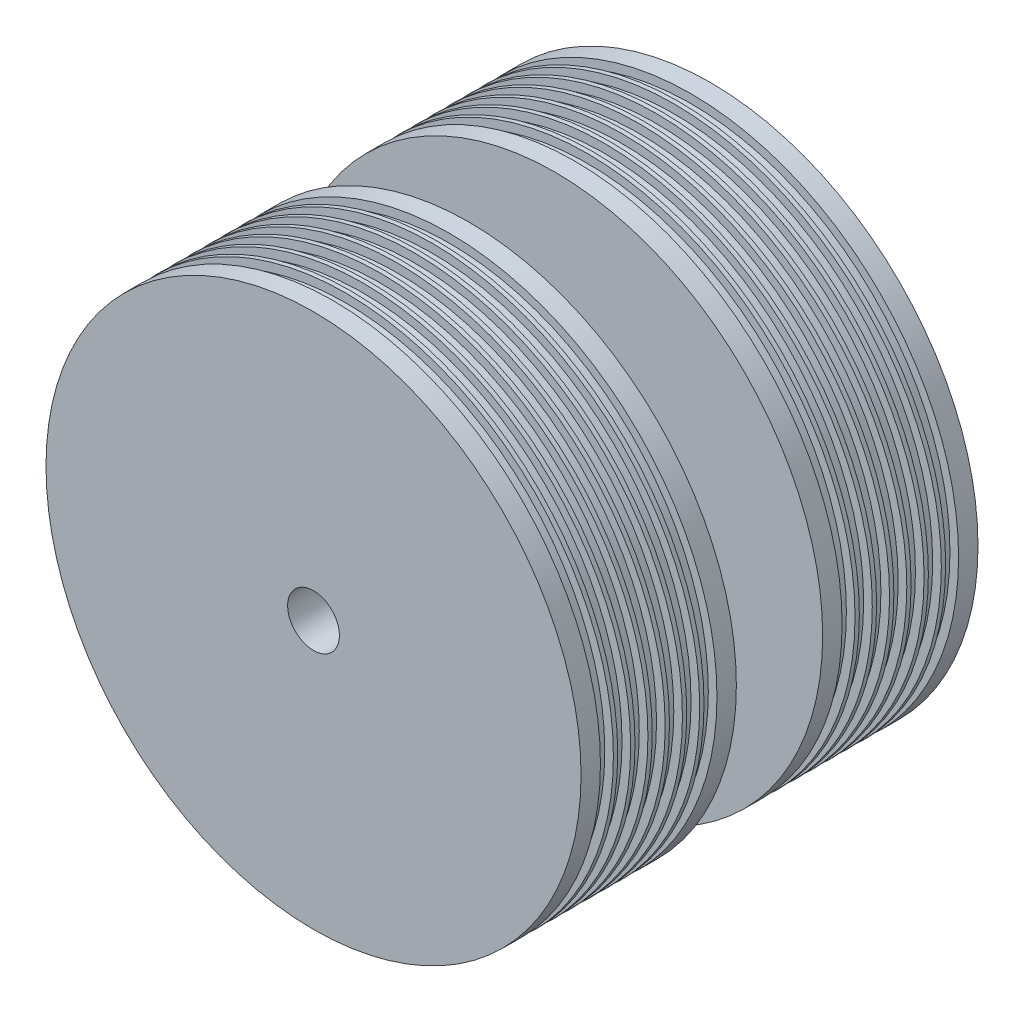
ISO-10303-21;
HEADER;
FILE_DESCRIPTION(('STEP AP214'),'2;1');
FILE_NAME('part.step','',(''),(''),'','','');
FILE_SCHEMA(('AUTOMOTIVE_DESIGN { 1 0 10303 214 1 1 1 1 }'));
ENDSEC;
DATA;
#1=APPLICATION_CONTEXT('core data for automotive mechanical design processes');
#2=APPLICATION_PROTOCOL_DEFINITION('international standard','automotive_design',2000,#1);
#3=PRODUCT_CONTEXT('',#1,'mechanical');
#4=PRODUCT('Part','Part','',(#3));
#5=PRODUCT_RELATED_PRODUCT_CATEGORY('part','',(#4));
#6=PRODUCT_DEFINITION_FORMATION('','',#4);
#7=PRODUCT_DEFINITION_CONTEXT('part definition',#1,'design');
#8=PRODUCT_DEFINITION('design','',#6,#7);
#9=PRODUCT_DEFINITION_SHAPE('','',#8);
#10=(LENGTH_UNIT() NAMED_UNIT(*) SI_UNIT(.MILLI.,.METRE.));
#11=(NAMED_UNIT(*) PLANE_ANGLE_UNIT() SI_UNIT($,.RADIAN.));
#12=(NAMED_UNIT(*) SI_UNIT($,.STERADIAN.) SOLID_ANGLE_UNIT());
#13=UNCERTAINTY_MEASURE_WITH_UNIT(LENGTH_MEASURE(1.E-05),#10,'distance_accuracy_value','');
#14=(GEOMETRIC_REPRESENTATION_CONTEXT(3) GLOBAL_UNCERTAINTY_ASSIGNED_CONTEXT((#13)) GLOBAL_UNIT_ASSIGNED_CONTEXT((#10,
#11,#12)) REPRESENTATION_CONTEXT('',''));
#15=CARTESIAN_POINT('',(0.,0.,0.));
#16=DIRECTION('',(0.,0.,1.));
#17=DIRECTION('',(1.,0.,0.));
#18=AXIS2_PLACEMENT_3D('',#15,#16,#17);
#19=CARTESIAN_POINT('',(0.,0.,0.));
#20=DIRECTION('',(0.,0.,1.));
#21=DIRECTION('',(1.,0.,0.));
#22=AXIS2_PLACEMENT_3D('',#19,#20,#21);
#23=CYLINDRICAL_SURFACE('',#22,15.5);
#24=CARTESIAN_POINT('',(0.,0.,-1.12500000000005));
#25=DIRECTION('',(0.,0.,1.));
#26=DIRECTION('',(1.,0.,0.));
#27=AXIS2_PLACEMENT_3D('',#24,#25,#26);
#28=CIRCLE('',#27,15.5);
#29=CARTESIAN_POINT('',(15.5,0.,-1.12500000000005));
#30=VERTEX_POINT('',#29);
#31=EDGE_CURVE('E11',#30,#30,#28,.T.);
#32=ORIENTED_EDGE('',*,*,#31,.T.);
#33=EDGE_LOOP('',(#32));
#34=FACE_BOUND('',#33,.T.);
#35=CARTESIAN_POINT('',(0.,0.,0.));
#36=DIRECTION('',(0.,0.,1.));
#37=DIRECTION('',(1.,0.,0.));
#38=AXIS2_PLACEMENT_3D('',#35,#36,#37);
#39=CIRCLE('',#38,15.5);
#40=CARTESIAN_POINT('',(15.5,0.,0.));
#41=VERTEX_POINT('',#40);
#42=EDGE_CURVE('E187',#41,#41,#39,.T.);
#43=ORIENTED_EDGE('',*,*,#42,.F.);
#44=EDGE_LOOP('',(#43));
#45=FACE_BOUND('',#44,.T.);
#46=ADVANCED_FACE('F55',(#34,#45),#23,.T.);
#47=CARTESIAN_POINT('',(0.,0.,-1.12500000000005));
#48=DIRECTION('',(0.,0.,-1.));
#49=DIRECTION('',(-1.,0.,0.));
#50=AXIS2_PLACEMENT_3D('',#47,#48,#49);
#51=PLANE('',#50);
#52=CARTESIAN_POINT('',(0.,0.,-1.12500000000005));
#53=DIRECTION('',(0.,0.,1.));
#54=DIRECTION('',(1.,0.,0.));
#55=AXIS2_PLACEMENT_3D('',#52,#53,#54);
#56=CIRCLE('',#55,15.0000000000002);
#57=CARTESIAN_POINT('',(15.0000000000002,0.,-1.12500000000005));
#58=VERTEX_POINT('',#57);
#59=EDGE_CURVE('E63',#58,#58,#56,.T.);
#60=ORIENTED_EDGE('',*,*,#59,.T.);
#61=EDGE_LOOP('',(#60));
#62=FACE_BOUND('',#61,.T.);
#63=ORIENTED_EDGE('',*,*,#31,.F.);
#64=EDGE_LOOP('',(#63));
#65=FACE_BOUND('',#64,.T.);
#66=ADVANCED_FACE('F57',(#62,#65),#51,.T.);
#67=CARTESIAN_POINT('',(0.,0.,0.));
#68=DIRECTION('',(0.,0.,1.));
#69=DIRECTION('',(1.,0.,0.));
#70=AXIS2_PLACEMENT_3D('',#67,#68,#69);
#71=CYLINDRICAL_SURFACE('',#70,15.0000000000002);
#72=ORIENTED_EDGE('',*,*,#59,.F.);
#73=EDGE_LOOP('',(#72));
#74=FACE_BOUND('',#73,.T.);
#75=CARTESIAN_POINT('',(0.,0.,-1.87500000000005));
#76=DIRECTION('',(0.,0.,1.));
#77=DIRECTION('',(1.,0.,0.));
#78=AXIS2_PLACEMENT_3D('',#75,#76,#77);
#79=CIRCLE('',#78,15.0000000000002);
#80=CARTESIAN_POINT('',(15.0000000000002,0.,-1.87500000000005));
#81=VERTEX_POINT('',#80);
#82=EDGE_CURVE('E68',#81,#81,#79,.T.);
#83=ORIENTED_EDGE('',*,*,#82,.T.);
#84=EDGE_LOOP('',(#83));
#85=FACE_BOUND('',#84,.T.);
#86=ADVANCED_FACE('F202',(#74,#85),#71,.T.);
#87=CARTESIAN_POINT('',(0.,0.,-1.87500000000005));
#88=DIRECTION('',(0.,0.,-1.));
#89=DIRECTION('',(-1.,0.,0.));
#90=AXIS2_PLACEMENT_3D('',#87,#88,#89);
#91=PLANE('',#90);
#92=ORIENTED_EDGE('',*,*,#82,.F.);
#93=EDGE_LOOP('',(#92));
#94=FACE_BOUND('',#93,.T.);
#95=CARTESIAN_POINT('',(0.,0.,-1.87500000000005));
#96=DIRECTION('',(0.,0.,1.));
#97=DIRECTION('',(1.,0.,0.));
#98=AXIS2_PLACEMENT_3D('',#95,#96,#97);
#99=CIRCLE('',#98,15.5);
#100=CARTESIAN_POINT('',(15.5,0.,-1.87500000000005));
#101=VERTEX_POINT('',#100);
#102=EDGE_CURVE('E73',#101,#101,#99,.T.);
#103=ORIENTED_EDGE('',*,*,#102,.T.);
#104=EDGE_LOOP('',(#103));
#105=FACE_BOUND('',#104,.T.);
#106=ADVANCED_FACE('F207',(#94,#105),#91,.F.);
#107=CARTESIAN_POINT('',(0.,0.,-2.12500000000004));
#108=DIRECTION('',(0.,0.,1.));
#109=DIRECTION('',(1.,0.,0.));
#110=AXIS2_PLACEMENT_3D('',#107,#108,#109);
#111=CIRCLE('',#110,15.5);
#112=CARTESIAN_POINT('',(15.5,0.,-2.12500000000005));
#113=VERTEX_POINT('',#112);
#114=EDGE_CURVE('E79',#113,#113,#111,.T.);
#115=ORIENTED_EDGE('',*,*,#114,.T.);
#116=EDGE_LOOP('',(#115));
#117=FACE_BOUND('',#116,.T.);
#118=ORIENTED_EDGE('',*,*,#102,.F.);
#119=EDGE_LOOP('',(#118));
#120=FACE_BOUND('',#119,.T.);
#121=ADVANCED_FACE('F197',(#117,#120),#23,.T.);
#122=CARTESIAN_POINT('',(0.,0.,-2.12500000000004));
#123=DIRECTION('',(0.,0.,-1.));
#124=DIRECTION('',(-1.,0.,0.));
#125=AXIS2_PLACEMENT_3D('',#122,#123,#124);
#126=PLANE('',#125);
#127=CARTESIAN_POINT('',(0.,0.,-2.12500000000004));
#128=DIRECTION('',(0.,0.,1.));
#129=DIRECTION('',(1.,0.,0.));
#130=AXIS2_PLACEMENT_3D('',#127,#128,#129);
#131=CIRCLE('',#130,15.0000000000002);
#132=CARTESIAN_POINT('',(15.0000000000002,0.,-2.12500000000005));
#133=VERTEX_POINT('',#132);
#134=EDGE_CURVE('E83',#133,#133,#131,.T.);
#135=ORIENTED_EDGE('',*,*,#134,.T.);
#136=EDGE_LOOP('',(#135));
#137=FACE_BOUND('',#136,.T.);
#138=ORIENTED_EDGE('',*,*,#114,.F.);
#139=EDGE_LOOP('',(#138));
#140=FACE_BOUND('',#139,.T.);
#141=ADVANCED_FACE('F206',(#137,#140),#126,.T.);
#142=CARTESIAN_POINT('',(0.,0.,0.));
#143=DIRECTION('',(0.,0.,1.));
#144=DIRECTION('',(1.,0.,0.));
#145=AXIS2_PLACEMENT_3D('',#142,#143,#144);
#146=CYLINDRICAL_SURFACE('',#145,15.0000000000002);
#147=ORIENTED_EDGE('',*,*,#134,.F.);
#148=EDGE_LOOP('',(#147));
#149=FACE_BOUND('',#148,.T.);
#150=CARTESIAN_POINT('',(0.,0.,-2.87500000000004));
#151=DIRECTION('',(0.,0.,1.));
#152=DIRECTION('',(1.,0.,0.));
#153=AXIS2_PLACEMENT_3D('',#150,#151,#152);
#154=CIRCLE('',#153,15.0000000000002);
#155=CARTESIAN_POINT('',(15.0000000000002,0.,-2.87500000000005));
#156=VERTEX_POINT('',#155);
#157=EDGE_CURVE('E87',#156,#156,#154,.T.);
#158=ORIENTED_EDGE('',*,*,#157,.T.);
#159=EDGE_LOOP('',(#158));
#160=FACE_BOUND('',#159,.T.);
#161=ADVANCED_FACE('F293',(#149,#160),#146,.T.);
#162=CARTESIAN_POINT('',(0.,0.,-2.87500000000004));
#163=DIRECTION('',(0.,0.,-1.));
#164=DIRECTION('',(-1.,0.,0.));
#165=AXIS2_PLACEMENT_3D('',#162,#163,#164);
#166=PLANE('',#165);
#167=ORIENTED_EDGE('',*,*,#157,.F.);
#168=EDGE_LOOP('',(#167));
#169=FACE_BOUND('',#168,.T.);
#170=CARTESIAN_POINT('',(0.,0.,-2.87500000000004));
#171=DIRECTION('',(0.,0.,1.));
#172=DIRECTION('',(1.,0.,0.));
#173=AXIS2_PLACEMENT_3D('',#170,#171,#172);
#174=CIRCLE('',#173,15.5);
#175=CARTESIAN_POINT('',(15.5,0.,-2.87500000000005));
#176=VERTEX_POINT('',#175);
#177=EDGE_CURVE('E91',#176,#176,#174,.T.);
#178=ORIENTED_EDGE('',*,*,#177,.T.);
#179=EDGE_LOOP('',(#178));
#180=FACE_BOUND('',#179,.T.);
#181=ADVANCED_FACE('F285',(#169,#180),#166,.F.);
#182=CARTESIAN_POINT('',(0.,0.,-3.12500000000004));
#183=DIRECTION('',(0.,0.,1.));
#184=DIRECTION('',(1.,0.,0.));
#185=AXIS2_PLACEMENT_3D('',#182,#183,#184);
#186=CIRCLE('',#185,15.5);
#187=CARTESIAN_POINT('',(15.5,0.,-3.12500000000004));
#188=VERTEX_POINT('',#187);
#189=EDGE_CURVE('E95',#188,#188,#186,.T.);
#190=ORIENTED_EDGE('',*,*,#189,.T.);
#191=EDGE_LOOP('',(#190));
#192=FACE_BOUND('',#191,.T.);
#193=ORIENTED_EDGE('',*,*,#177,.F.);
#194=EDGE_LOOP('',(#193));
#195=FACE_BOUND('',#194,.T.);
#196=ADVANCED_FACE('F209',(#192,#195),#23,.T.);
#197=CARTESIAN_POINT('',(0.,0.,-3.12500000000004));
#198=DIRECTION('',(0.,0.,-1.));
#199=DIRECTION('',(-1.,0.,0.));
#200=AXIS2_PLACEMENT_3D('',#197,#198,#199);
#201=PLANE('',#200);
#202=CARTESIAN_POINT('',(0.,0.,-3.12500000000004));
#203=DIRECTION('',(0.,0.,1.));
#204=DIRECTION('',(1.,0.,0.));
#205=AXIS2_PLACEMENT_3D('',#202,#203,#204);
#206=CIRCLE('',#205,15.0000000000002);
#207=CARTESIAN_POINT('',(15.0000000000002,0.,-3.12500000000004));
#208=VERTEX_POINT('',#207);
#209=EDGE_CURVE('E99',#208,#208,#206,.T.);
#210=ORIENTED_EDGE('',*,*,#209,.T.);
#211=EDGE_LOOP('',(#210));
#212=FACE_BOUND('',#211,.T.);
#213=ORIENTED_EDGE('',*,*,#189,.F.);
#214=EDGE_LOOP('',(#213));
#215=FACE_BOUND('',#214,.T.);
#216=ADVANCED_FACE('F284',(#212,#215),#201,.T.);
#217=CARTESIAN_POINT('',(0.,0.,0.));
#218=DIRECTION('',(0.,0.,1.));
#219=DIRECTION('',(1.,0.,0.));
#220=AXIS2_PLACEMENT_3D('',#217,#218,#219);
#221=CYLINDRICAL_SURFACE('',#220,15.0000000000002);
#222=ORIENTED_EDGE('',*,*,#209,.F.);
#223=EDGE_LOOP('',(#222));
#224=FACE_BOUND('',#223,.T.);
#225=CARTESIAN_POINT('',(0.,0.,-3.87500000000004));
#226=DIRECTION('',(0.,0.,1.));
#227=DIRECTION('',(1.,0.,0.));
#228=AXIS2_PLACEMENT_3D('',#225,#226,#227);
#229=CIRCLE('',#228,15.0000000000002);
#230=CARTESIAN_POINT('',(15.0000000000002,0.,-3.87500000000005));
#231=VERTEX_POINT('',#230);
#232=EDGE_CURVE('E103',#231,#231,#229,.T.);
#233=ORIENTED_EDGE('',*,*,#232,.T.);
#234=EDGE_LOOP('',(#233));
#235=FACE_BOUND('',#234,.T.);
#236=ADVANCED_FACE('F279',(#224,#235),#221,.T.);
#237=CARTESIAN_POINT('',(0.,0.,-3.87500000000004));
#238=DIRECTION('',(0.,0.,-1.));
#239=DIRECTION('',(-1.,0.,0.));
#240=AXIS2_PLACEMENT_3D('',#237,#238,#239);
#241=PLANE('',#240);
#242=ORIENTED_EDGE('',*,*,#232,.F.);
#243=EDGE_LOOP('',(#242));
#244=FACE_BOUND('',#243,.T.);
#245=CARTESIAN_POINT('',(0.,0.,-3.87500000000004));
#246=DIRECTION('',(0.,0.,1.));
#247=DIRECTION('',(1.,0.,0.));
#248=AXIS2_PLACEMENT_3D('',#245,#246,#247);
#249=CIRCLE('',#248,15.5);
#250=CARTESIAN_POINT('',(15.5,0.,-3.87500000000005));
#251=VERTEX_POINT('',#250);
#252=EDGE_CURVE('E107',#251,#251,#249,.T.);
#253=ORIENTED_EDGE('',*,*,#252,.T.);
#254=EDGE_LOOP('',(#253));
#255=FACE_BOUND('',#254,.T.);
#256=ADVANCED_FACE('F271',(#244,#255),#241,.F.);
#257=CARTESIAN_POINT('',(0.,0.,-4.12500000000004));
#258=DIRECTION('',(0.,0.,1.));
#259=DIRECTION('',(1.,0.,0.));
#260=AXIS2_PLACEMENT_3D('',#257,#258,#259);
#261=CIRCLE('',#260,15.5);
#262=CARTESIAN_POINT('',(15.5,0.,-4.12500000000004));
#263=VERTEX_POINT('',#262);
#264=EDGE_CURVE('E111',#263,#263,#261,.T.);
#265=ORIENTED_EDGE('',*,*,#264,.T.);
#266=EDGE_LOOP('',(#265));
#267=FACE_BOUND('',#266,.T.);
#268=ORIENTED_EDGE('',*,*,#252,.F.);
#269=EDGE_LOOP('',(#268));
#270=FACE_BOUND('',#269,.T.);
#271=ADVANCED_FACE('F258',(#267,#270),#23,.T.);
#272=CARTESIAN_POINT('',(0.,0.,-4.12500000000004));
#273=DIRECTION('',(0.,0.,-1.));
#274=DIRECTION('',(-1.,0.,0.));
#275=AXIS2_PLACEMENT_3D('',#272,#273,#274);
#276=PLANE('',#275);
#277=CARTESIAN_POINT('',(0.,0.,-4.12500000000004));
#278=DIRECTION('',(0.,0.,1.));
#279=DIRECTION('',(1.,0.,0.));
#280=AXIS2_PLACEMENT_3D('',#277,#278,#279);
#281=CIRCLE('',#280,15.0000000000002);
#282=CARTESIAN_POINT('',(15.0000000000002,0.,-4.12500000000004));
#283=VERTEX_POINT('',#282);
#284=EDGE_CURVE('E115',#283,#283,#281,.T.);
#285=ORIENTED_EDGE('',*,*,#284,.T.);
#286=EDGE_LOOP('',(#285));
#287=FACE_BOUND('',#286,.T.);
#288=ORIENTED_EDGE('',*,*,#264,.F.);
#289=EDGE_LOOP('',(#288));
#290=FACE_BOUND('',#289,.T.);
#291=ADVANCED_FACE('F270',(#287,#290),#276,.T.);
#292=CARTESIAN_POINT('',(0.,0.,0.));
#293=DIRECTION('',(0.,0.,1.));
#294=DIRECTION('',(1.,0.,0.));
#295=AXIS2_PLACEMENT_3D('',#292,#293,#294);
#296=CYLINDRICAL_SURFACE('',#295,15.0000000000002);
#297=ORIENTED_EDGE('',*,*,#284,.F.);
#298=EDGE_LOOP('',(#297));
#299=FACE_BOUND('',#298,.T.);
#300=CARTESIAN_POINT('',(0.,0.,-4.87500000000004));
#301=DIRECTION('',(0.,0.,1.));
#302=DIRECTION('',(1.,0.,0.));
#303=AXIS2_PLACEMENT_3D('',#300,#301,#302);
#304=CIRCLE('',#303,15.0000000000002);
#305=CARTESIAN_POINT('',(15.0000000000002,0.,-4.87500000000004));
#306=VERTEX_POINT('',#305);
#307=EDGE_CURVE('E119',#306,#306,#304,.T.);
#308=ORIENTED_EDGE('',*,*,#307,.T.);
#309=EDGE_LOOP('',(#308));
#310=FACE_BOUND('',#309,.T.);
#311=ADVANCED_FACE('F265',(#299,#310),#296,.T.);
#312=CARTESIAN_POINT('',(0.,0.,-4.87500000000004));
#313=DIRECTION('',(0.,0.,-1.));
#314=DIRECTION('',(-1.,0.,0.));
#315=AXIS2_PLACEMENT_3D('',#312,#313,#314);
#316=PLANE('',#315);
#317=ORIENTED_EDGE('',*,*,#307,.F.);
#318=EDGE_LOOP('',(#317));
#319=FACE_BOUND('',#318,.T.);
#320=CARTESIAN_POINT('',(0.,0.,-4.87500000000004));
#321=DIRECTION('',(0.,0.,1.));
#322=DIRECTION('',(1.,0.,0.));
#323=AXIS2_PLACEMENT_3D('',#320,#321,#322);
#324=CIRCLE('',#323,15.5);
#325=CARTESIAN_POINT('',(15.5,0.,-4.87500000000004));
#326=VERTEX_POINT('',#325);
#327=EDGE_CURVE('E123',#326,#326,#324,.T.);
#328=ORIENTED_EDGE('',*,*,#327,.T.);
#329=EDGE_LOOP('',(#328));
#330=FACE_BOUND('',#329,.T.);
#331=ADVANCED_FACE('F256',(#319,#330),#316,.F.);
#332=CARTESIAN_POINT('',(0.,0.,-5.12500000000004));
#333=DIRECTION('',(0.,0.,1.));
#334=DIRECTION('',(1.,0.,0.));
#335=AXIS2_PLACEMENT_3D('',#332,#333,#334);
#336=CIRCLE('',#335,15.5);
#337=CARTESIAN_POINT('',(15.5,0.,-5.12500000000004));
#338=VERTEX_POINT('',#337);
#339=EDGE_CURVE('E127',#338,#338,#336,.T.);
#340=ORIENTED_EDGE('',*,*,#339,.T.);
#341=EDGE_LOOP('',(#340));
#342=FACE_BOUND('',#341,.T.);
#343=ORIENTED_EDGE('',*,*,#327,.F.);
#344=EDGE_LOOP('',(#343));
#345=FACE_BOUND('',#344,.T.);
#346=ADVANCED_FACE('F243',(#342,#345),#23,.T.);
#347=CARTESIAN_POINT('',(0.,0.,-5.12500000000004));
#348=DIRECTION('',(0.,0.,-1.));
#349=DIRECTION('',(-1.,0.,0.));
#350=AXIS2_PLACEMENT_3D('',#347,#348,#349);
#351=PLANE('',#350);
#352=CARTESIAN_POINT('',(0.,0.,-5.12500000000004));
#353=DIRECTION('',(0.,0.,1.));
#354=DIRECTION('',(1.,0.,0.));
#355=AXIS2_PLACEMENT_3D('',#352,#353,#354);
#356=CIRCLE('',#355,15.0000000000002);
#357=CARTESIAN_POINT('',(15.0000000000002,0.,-5.12500000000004));
#358=VERTEX_POINT('',#357);
#359=EDGE_CURVE('E131',#358,#358,#356,.T.);
#360=ORIENTED_EDGE('',*,*,#359,.T.);
#361=EDGE_LOOP('',(#360));
#362=FACE_BOUND('',#361,.T.);
#363=ORIENTED_EDGE('',*,*,#339,.F.);
#364=EDGE_LOOP('',(#363));
#365=FACE_BOUND('',#364,.T.);
#366=ADVANCED_FACE('F255',(#362,#365),#351,.T.);
#367=CARTESIAN_POINT('',(0.,0.,0.));
#368=DIRECTION('',(0.,0.,1.));
#369=DIRECTION('',(1.,0.,0.));
#370=AXIS2_PLACEMENT_3D('',#367,#368,#369);
#371=CYLINDRICAL_SURFACE('',#370,15.0000000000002);
#372=ORIENTED_EDGE('',*,*,#359,.F.);
#373=EDGE_LOOP('',(#372));
#374=FACE_BOUND('',#373,.T.);
#375=CARTESIAN_POINT('',(0.,0.,-5.87500000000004));
#376=DIRECTION('',(0.,0.,1.));
#377=DIRECTION('',(1.,0.,0.));
#378=AXIS2_PLACEMENT_3D('',#375,#376,#377);
#379=CIRCLE('',#378,15.0000000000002);
#380=CARTESIAN_POINT('',(15.0000000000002,0.,-5.87500000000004));
#381=VERTEX_POINT('',#380);
#382=EDGE_CURVE('E135',#381,#381,#379,.T.);
#383=ORIENTED_EDGE('',*,*,#382,.T.);
#384=EDGE_LOOP('',(#383));
#385=FACE_BOUND('',#384,.T.);
#386=ADVANCED_FACE('F250',(#374,#385),#371,.T.);
#387=CARTESIAN_POINT('',(0.,0.,-5.87500000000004));
#388=DIRECTION('',(0.,0.,-1.));
#389=DIRECTION('',(-1.,0.,0.));
#390=AXIS2_PLACEMENT_3D('',#387,#388,#389);
#391=PLANE('',#390);
#392=ORIENTED_EDGE('',*,*,#382,.F.);
#393=EDGE_LOOP('',(#392));
#394=FACE_BOUND('',#393,.T.);
#395=CARTESIAN_POINT('',(0.,0.,-5.87500000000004));
#396=DIRECTION('',(0.,0.,1.));
#397=DIRECTION('',(1.,0.,0.));
#398=AXIS2_PLACEMENT_3D('',#395,#396,#397);
#399=CIRCLE('',#398,15.5);
#400=CARTESIAN_POINT('',(15.5,0.,-5.87500000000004));
#401=VERTEX_POINT('',#400);
#402=EDGE_CURVE('E139',#401,#401,#399,.T.);
#403=ORIENTED_EDGE('',*,*,#402,.T.);
#404=EDGE_LOOP('',(#403));
#405=FACE_BOUND('',#404,.T.);
#406=ADVANCED_FACE('F241',(#394,#405),#391,.F.);
#407=CARTESIAN_POINT('',(0.,0.,-6.12500000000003));
#408=DIRECTION('',(0.,0.,1.));
#409=DIRECTION('',(1.,0.,0.));
#410=AXIS2_PLACEMENT_3D('',#407,#408,#409);
#411=CIRCLE('',#410,15.5);
#412=CARTESIAN_POINT('',(15.5,0.,-6.12500000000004));
#413=VERTEX_POINT('',#412);
#414=EDGE_CURVE('E143',#413,#413,#411,.T.);
#415=ORIENTED_EDGE('',*,*,#414,.T.);
#416=EDGE_LOOP('',(#415));
#417=FACE_BOUND('',#416,.T.);
#418=ORIENTED_EDGE('',*,*,#402,.F.);
#419=EDGE_LOOP('',(#418));
#420=FACE_BOUND('',#419,.T.);
#421=ADVANCED_FACE('F228',(#417,#420),#23,.T.);
#422=CARTESIAN_POINT('',(0.,0.,-6.12500000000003));
#423=DIRECTION('',(0.,0.,-1.));
#424=DIRECTION('',(-1.,0.,0.));
#425=AXIS2_PLACEMENT_3D('',#422,#423,#424);
#426=PLANE('',#425);
#427=CARTESIAN_POINT('',(0.,0.,-6.12500000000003));
#428=DIRECTION('',(0.,0.,1.));
#429=DIRECTION('',(1.,0.,0.));
#430=AXIS2_PLACEMENT_3D('',#427,#428,#429);
#431=CIRCLE('',#430,15.0000000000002);
#432=CARTESIAN_POINT('',(15.0000000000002,0.,-6.12500000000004));
#433=VERTEX_POINT('',#432);
#434=EDGE_CURVE('E147',#433,#433,#431,.T.);
#435=ORIENTED_EDGE('',*,*,#434,.T.);
#436=EDGE_LOOP('',(#435));
#437=FACE_BOUND('',#436,.T.);
#438=ORIENTED_EDGE('',*,*,#414,.F.);
#439=EDGE_LOOP('',(#438));
#440=FACE_BOUND('',#439,.T.);
#441=ADVANCED_FACE('F240',(#437,#440),#426,.T.);
#442=CARTESIAN_POINT('',(0.,0.,0.));
#443=DIRECTION('',(0.,0.,1.));
#444=DIRECTION('',(1.,0.,0.));
#445=AXIS2_PLACEMENT_3D('',#442,#443,#444);
#446=CYLINDRICAL_SURFACE('',#445,15.0000000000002);
#447=ORIENTED_EDGE('',*,*,#434,.F.);
#448=EDGE_LOOP('',(#447));
#449=FACE_BOUND('',#448,.T.);
#450=CARTESIAN_POINT('',(0.,0.,-6.87500000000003));
#451=DIRECTION('',(0.,0.,1.));
#452=DIRECTION('',(1.,0.,0.));
#453=AXIS2_PLACEMENT_3D('',#450,#451,#452);
#454=CIRCLE('',#453,15.0000000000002);
#455=CARTESIAN_POINT('',(15.0000000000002,0.,-6.87500000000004));
#456=VERTEX_POINT('',#455);
#457=EDGE_CURVE('E151',#456,#456,#454,.T.);
#458=ORIENTED_EDGE('',*,*,#457,.T.);
#459=EDGE_LOOP('',(#458));
#460=FACE_BOUND('',#459,.T.);
#461=ADVANCED_FACE('F235',(#449,#460),#446,.T.);
#462=CARTESIAN_POINT('',(0.,0.,-6.87500000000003));
#463=DIRECTION('',(0.,0.,-1.));
#464=DIRECTION('',(-1.,0.,0.));
#465=AXIS2_PLACEMENT_3D('',#462,#463,#464);
#466=PLANE('',#465);
#467=ORIENTED_EDGE('',*,*,#457,.F.);
#468=EDGE_LOOP('',(#467));
#469=FACE_BOUND('',#468,.T.);
#470=CARTESIAN_POINT('',(0.,0.,-6.87500000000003));
#471=DIRECTION('',(0.,0.,1.));
#472=DIRECTION('',(1.,0.,0.));
#473=AXIS2_PLACEMENT_3D('',#470,#471,#472);
#474=CIRCLE('',#473,15.5);
#475=CARTESIAN_POINT('',(15.5,0.,-6.87500000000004));
#476=VERTEX_POINT('',#475);
#477=EDGE_CURVE('E155',#476,#476,#474,.T.);
#478=ORIENTED_EDGE('',*,*,#477,.T.);
#479=EDGE_LOOP('',(#478));
#480=FACE_BOUND('',#479,.T.);
#481=ADVANCED_FACE('F226',(#469,#480),#466,.F.);
#482=CARTESIAN_POINT('',(0.,0.,-7.12500000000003));
#483=DIRECTION('',(0.,0.,1.));
#484=DIRECTION('',(1.,0.,0.));
#485=AXIS2_PLACEMENT_3D('',#482,#483,#484);
#486=CIRCLE('',#485,15.5);
#487=CARTESIAN_POINT('',(15.5,0.,-7.12500000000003));
#488=VERTEX_POINT('',#487);
#489=EDGE_CURVE('E159',#488,#488,#486,.T.);
#490=ORIENTED_EDGE('',*,*,#489,.T.);
#491=EDGE_LOOP('',(#490));
#492=FACE_BOUND('',#491,.T.);
#493=ORIENTED_EDGE('',*,*,#477,.F.);
#494=EDGE_LOOP('',(#493));
#495=FACE_BOUND('',#494,.T.);
#496=ADVANCED_FACE('F214',(#492,#495),#23,.T.);
#497=CARTESIAN_POINT('',(0.,0.,-7.12500000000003));
#498=DIRECTION('',(0.,0.,-1.));
#499=DIRECTION('',(-1.,0.,0.));
#500=AXIS2_PLACEMENT_3D('',#497,#498,#499);
#501=PLANE('',#500);
#502=CARTESIAN_POINT('',(0.,0.,-7.12500000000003));
#503=DIRECTION('',(0.,0.,1.));
#504=DIRECTION('',(1.,0.,0.));
#505=AXIS2_PLACEMENT_3D('',#502,#503,#504);
#506=CIRCLE('',#505,15.0000000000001);
#507=CARTESIAN_POINT('',(15.0000000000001,0.,-7.12500000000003));
#508=VERTEX_POINT('',#507);
#509=EDGE_CURVE('E163',#508,#508,#506,.T.);
#510=ORIENTED_EDGE('',*,*,#509,.T.);
#511=EDGE_LOOP('',(#510));
#512=FACE_BOUND('',#511,.T.);
#513=ORIENTED_EDGE('',*,*,#489,.F.);
#514=EDGE_LOOP('',(#513));
#515=FACE_BOUND('',#514,.T.);
#516=ADVANCED_FACE('F225',(#512,#515),#501,.T.);
#517=CARTESIAN_POINT('',(0.,0.,0.));
#518=DIRECTION('',(0.,0.,1.));
#519=DIRECTION('',(1.,0.,0.));
#520=AXIS2_PLACEMENT_3D('',#517,#518,#519);
#521=CYLINDRICAL_SURFACE('',#520,15.0000000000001);
#522=ORIENTED_EDGE('',*,*,#509,.F.);
#523=EDGE_LOOP('',(#522));
#524=FACE_BOUND('',#523,.T.);
#525=CARTESIAN_POINT('',(0.,0.,-7.87500000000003));
#526=DIRECTION('',(0.,0.,1.));
#527=DIRECTION('',(1.,0.,0.));
#528=AXIS2_PLACEMENT_3D('',#525,#526,#527);
#529=CIRCLE('',#528,15.0000000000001);
#530=CARTESIAN_POINT('',(15.0000000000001,0.,-7.87500000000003));
#531=VERTEX_POINT('',#530);
#532=EDGE_CURVE('E167',#531,#531,#529,.T.);
#533=ORIENTED_EDGE('',*,*,#532,.T.);
#534=EDGE_LOOP('',(#533));
#535=FACE_BOUND('',#534,.T.);
#536=ADVANCED_FACE('F221',(#524,#535),#521,.T.);
#537=CARTESIAN_POINT('',(0.,0.,-7.87500000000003));
#538=DIRECTION('',(0.,0.,-1.));
#539=DIRECTION('',(-1.,0.,0.));
#540=AXIS2_PLACEMENT_3D('',#537,#538,#539);
#541=PLANE('',#540);
#542=ORIENTED_EDGE('',*,*,#532,.F.);
#543=EDGE_LOOP('',(#542));
#544=FACE_BOUND('',#543,.T.);
#545=CARTESIAN_POINT('',(0.,0.,-7.87500000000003));
#546=DIRECTION('',(0.,0.,1.));
#547=DIRECTION('',(1.,0.,0.));
#548=AXIS2_PLACEMENT_3D('',#545,#546,#547);
#549=CIRCLE('',#548,15.5);
#550=CARTESIAN_POINT('',(15.5,0.,-7.87500000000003));
#551=VERTEX_POINT('',#550);
#552=EDGE_CURVE('E171',#551,#551,#549,.T.);
#553=ORIENTED_EDGE('',*,*,#552,.T.);
#554=EDGE_LOOP('',(#553));
#555=FACE_BOUND('',#554,.T.);
#556=ADVANCED_FACE('F212',(#544,#555),#541,.F.);
#557=CARTESIAN_POINT('',(0.,0.,-9.));
#558=DIRECTION('',(0.,0.,1.));
#559=DIRECTION('',(1.,0.,0.));
#560=AXIS2_PLACEMENT_3D('',#557,#558,#559);
#561=CIRCLE('',#560,15.5);
#562=CARTESIAN_POINT('',(15.5,0.,-9.));
#563=VERTEX_POINT('',#562);
#564=EDGE_CURVE('E175',#563,#563,#561,.T.);
#565=ORIENTED_EDGE('',*,*,#564,.T.);
#566=EDGE_LOOP('',(#565));
#567=FACE_BOUND('',#566,.T.);
#568=ORIENTED_EDGE('',*,*,#552,.F.);
#569=EDGE_LOOP('',(#568));
#570=FACE_BOUND('',#569,.T.);
#571=ADVANCED_FACE('F198',(#567,#570),#23,.T.);
#572=CARTESIAN_POINT('',(0.,0.,-9.));
#573=DIRECTION('',(0.,0.,1.));
#574=DIRECTION('',(1.,0.,0.));
#575=AXIS2_PLACEMENT_3D('',#572,#573,#574);
#576=PLANE('',#575);
#577=ORIENTED_EDGE('',*,*,#564,.F.);
#578=EDGE_LOOP('',(#577));
#579=FACE_BOUND('',#578,.T.);
#580=CARTESIAN_POINT('',(0.,0.,-9.));
#581=DIRECTION('',(0.,0.,1.));
#582=DIRECTION('',(1.,0.,0.));
#583=AXIS2_PLACEMENT_3D('',#580,#581,#582);
#584=CIRCLE('',#583,1.5);
#585=CARTESIAN_POINT('',(1.5,0.,-9.));
#586=VERTEX_POINT('',#585);
#587=EDGE_CURVE('E179',#586,#586,#584,.T.);
#588=ORIENTED_EDGE('',*,*,#587,.T.);
#589=EDGE_LOOP('',(#588));
#590=FACE_BOUND('',#589,.T.);
#591=ADVANCED_FACE('F211',(#579,#590),#576,.F.);
#592=CARTESIAN_POINT('',(0.,0.,0.));
#593=DIRECTION('',(0.,0.,1.));
#594=DIRECTION('',(1.,0.,0.));
#595=AXIS2_PLACEMENT_3D('',#592,#593,#594);
#596=CYLINDRICAL_SURFACE('',#595,1.5);
#597=CARTESIAN_POINT('',(0.,0.,0.));
#598=DIRECTION('',(0.,0.,1.));
#599=DIRECTION('',(1.,0.,0.));
#600=AXIS2_PLACEMENT_3D('',#597,#598,#599);
#601=CIRCLE('',#600,1.5);
#602=CARTESIAN_POINT('',(1.5,0.,0.));
#603=VERTEX_POINT('',#602);
#604=EDGE_CURVE('E183',#603,#603,#601,.T.);
#605=ORIENTED_EDGE('',*,*,#604,.T.);
#606=EDGE_LOOP('',(#605));
#607=FACE_BOUND('',#606,.T.);
#608=ORIENTED_EDGE('',*,*,#587,.F.);
#609=EDGE_LOOP('',(#608));
#610=FACE_BOUND('',#609,.T.);
#611=ADVANCED_FACE('F219',(#607,#610),#596,.F.);
#612=CARTESIAN_POINT('',(0.,0.,0.));
#613=DIRECTION('',(0.,0.,1.));
#614=DIRECTION('',(1.,0.,0.));
#615=AXIS2_PLACEMENT_3D('',#612,#613,#614);
#616=PLANE('',#615);
#617=ORIENTED_EDGE('',*,*,#42,.T.);
#618=EDGE_LOOP('',(#617));
#619=FACE_BOUND('',#618,.T.);
#620=ORIENTED_EDGE('',*,*,#604,.F.);
#621=EDGE_LOOP('',(#620));
#622=FACE_BOUND('',#621,.T.);
#623=ADVANCED_FACE('F192',(#619,#622),#616,.T.);
#624=CLOSED_SHELL('',(#46,#66,#86,#106,#121,#141,#161,#181,#196,#216,#236,#256,#271,#291,#311,
#331,#346,#366,#386,#406,#421,#441,#461,#481,#496,#516,#536,#556,#571,#591,#611,#623));
#625=MANIFOLD_SOLID_BREP('B2',#624);
#626=CARTESIAN_POINT('',(0.,0.,0.));
#627=DIRECTION('',(0.,0.,1.));
#628=DIRECTION('',(1.,0.,0.));
#629=AXIS2_PLACEMENT_3D('',#626,#627,#628);
#630=CYLINDRICAL_SURFACE('',#629,15.5);
#631=CARTESIAN_POINT('',(0.,0.,-15.125));
#632=DIRECTION('',(0.,0.,1.));
#633=DIRECTION('',(1.,0.,0.));
#634=AXIS2_PLACEMENT_3D('',#631,#632,#633);
#635=CIRCLE('',#634,15.5);
#636=CARTESIAN_POINT('',(15.5,0.,-15.125));
#637=VERTEX_POINT('',#636);
#638=EDGE_CURVE('E54',#637,#637,#635,.T.);
#639=ORIENTED_EDGE('',*,*,#638,.T.);
#640=EDGE_LOOP('',(#639));
#641=FACE_BOUND('',#640,.T.);
#642=CARTESIAN_POINT('',(0.,0.,-14.));
#643=DIRECTION('',(0.,0.,1.));
#644=DIRECTION('',(1.,0.,0.));
#645=AXIS2_PLACEMENT_3D('',#642,#643,#644);
#646=CIRCLE('',#645,15.5);
#647=CARTESIAN_POINT('',(15.5,0.,-14.));
#648=VERTEX_POINT('',#647);
#649=EDGE_CURVE('E669',#648,#648,#646,.T.);
#650=ORIENTED_EDGE('',*,*,#649,.F.);
#651=EDGE_LOOP('',(#650));
#652=FACE_BOUND('',#651,.T.);
#653=ADVANCED_FACE('F568',(#641,#652),#630,.T.);
#654=CARTESIAN_POINT('',(0.,0.,-15.125));
#655=DIRECTION('',(0.,0.,-1.));
#656=DIRECTION('',(-1.,0.,0.));
#657=AXIS2_PLACEMENT_3D('',#654,#655,#656);
#658=PLANE('',#657);
#659=CARTESIAN_POINT('',(0.,0.,-15.125));
#660=DIRECTION('',(0.,0.,1.));
#661=DIRECTION('',(1.,0.,0.));
#662=AXIS2_PLACEMENT_3D('',#659,#660,#661);
#663=CIRCLE('',#662,15.0000000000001);
#664=CARTESIAN_POINT('',(15.0000000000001,0.,-15.125));
#665=VERTEX_POINT('',#664);
#666=EDGE_CURVE('E575',#665,#665,#663,.T.);
#667=ORIENTED_EDGE('',*,*,#666,.T.);
#668=EDGE_LOOP('',(#667));
#669=FACE_BOUND('',#668,.T.);
#670=ORIENTED_EDGE('',*,*,#638,.F.);
#671=EDGE_LOOP('',(#670));
#672=FACE_BOUND('',#671,.T.);
#673=ADVANCED_FACE('F570',(#669,#672),#658,.T.);
#674=CARTESIAN_POINT('',(0.,0.,0.));
#675=DIRECTION('',(0.,0.,1.));
#676=DIRECTION('',(1.,0.,0.));
#677=AXIS2_PLACEMENT_3D('',#674,#675,#676);
#678=CYLINDRICAL_SURFACE('',#677,15.0000000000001);
#679=ORIENTED_EDGE('',*,*,#666,.F.);
#680=EDGE_LOOP('',(#679));
#681=FACE_BOUND('',#680,.T.);
#682=CARTESIAN_POINT('',(0.,0.,-15.875));
#683=DIRECTION('',(0.,0.,1.));
#684=DIRECTION('',(1.,0.,0.));
#685=AXIS2_PLACEMENT_3D('',#682,#683,#684);
#686=CIRCLE('',#685,15.0000000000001);
#687=CARTESIAN_POINT('',(15.0000000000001,0.,-15.875));
#688=VERTEX_POINT('',#687);
#689=EDGE_CURVE('E579',#688,#688,#686,.T.);
#690=ORIENTED_EDGE('',*,*,#689,.T.);
#691=EDGE_LOOP('',(#690));
#692=FACE_BOUND('',#691,.T.);
#693=ADVANCED_FACE('F683',(#681,#692),#678,.T.);
#694=CARTESIAN_POINT('',(0.,0.,-15.875));
#695=DIRECTION('',(0.,0.,-1.));
#696=DIRECTION('',(-1.,0.,0.));
#697=AXIS2_PLACEMENT_3D('',#694,#695,#696);
#698=PLANE('',#697);
#699=ORIENTED_EDGE('',*,*,#689,.F.);
#700=EDGE_LOOP('',(#699));
#701=FACE_BOUND('',#700,.T.);
#702=CARTESIAN_POINT('',(0.,0.,-15.875));
#703=DIRECTION('',(0.,0.,1.));
#704=DIRECTION('',(1.,0.,0.));
#705=AXIS2_PLACEMENT_3D('',#702,#703,#704);
#706=CIRCLE('',#705,15.5);
#707=CARTESIAN_POINT('',(15.5,0.,-15.875));
#708=VERTEX_POINT('',#707);
#709=EDGE_CURVE('E583',#708,#708,#706,.T.);
#710=ORIENTED_EDGE('',*,*,#709,.T.);
#711=EDGE_LOOP('',(#710));
#712=FACE_BOUND('',#711,.T.);
#713=ADVANCED_FACE('F688',(#701,#712),#698,.F.);
#714=CARTESIAN_POINT('',(0.,0.,-16.125));
#715=DIRECTION('',(0.,0.,1.));
#716=DIRECTION('',(1.,0.,0.));
#717=AXIS2_PLACEMENT_3D('',#714,#715,#716);
#718=CIRCLE('',#717,15.5);
#719=CARTESIAN_POINT('',(15.5,0.,-16.125));
#720=VERTEX_POINT('',#719);
#721=EDGE_CURVE('E588',#720,#720,#718,.T.);
#722=ORIENTED_EDGE('',*,*,#721,.T.);
#723=EDGE_LOOP('',(#722));
#724=FACE_BOUND('',#723,.T.);
#725=ORIENTED_EDGE('',*,*,#709,.F.);
#726=EDGE_LOOP('',(#725));
#727=FACE_BOUND('',#726,.T.);
#728=ADVANCED_FACE('F678',(#724,#727),#630,.T.);
#729=CARTESIAN_POINT('',(0.,0.,-16.125));
#730=DIRECTION('',(0.,0.,-1.));
#731=DIRECTION('',(-1.,0.,0.));
#732=AXIS2_PLACEMENT_3D('',#729,#730,#731);
#733=PLANE('',#732);
#734=CARTESIAN_POINT('',(0.,0.,-16.125));
#735=DIRECTION('',(0.,0.,1.));
#736=DIRECTION('',(1.,0.,0.));
#737=AXIS2_PLACEMENT_3D('',#734,#735,#736);
#738=CIRCLE('',#737,15.);
#739=CARTESIAN_POINT('',(15.,0.,-16.125));
#740=VERTEX_POINT('',#739);
#741=EDGE_CURVE('E591',#740,#740,#738,.T.);
#742=ORIENTED_EDGE('',*,*,#741,.T.);
#743=EDGE_LOOP('',(#742));
#744=FACE_BOUND('',#743,.T.);
#745=ORIENTED_EDGE('',*,*,#721,.F.);
#746=EDGE_LOOP('',(#745));
#747=FACE_BOUND('',#746,.T.);
#748=ADVANCED_FACE('F687',(#744,#747),#733,.T.);
#749=CARTESIAN_POINT('',(0.,0.,0.));
#750=DIRECTION('',(0.,0.,1.));
#751=DIRECTION('',(1.,0.,0.));
#752=AXIS2_PLACEMENT_3D('',#749,#750,#751);
#753=CYLINDRICAL_SURFACE('',#752,15.0000000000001);
#754=ORIENTED_EDGE('',*,*,#741,.F.);
#755=EDGE_LOOP('',(#754));
#756=FACE_BOUND('',#755,.T.);
#757=CARTESIAN_POINT('',(0.,0.,-16.875));
#758=DIRECTION('',(0.,0.,1.));
#759=DIRECTION('',(1.,0.,0.));
#760=AXIS2_PLACEMENT_3D('',#757,#758,#759);
#761=CIRCLE('',#760,15.0000000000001);
#762=CARTESIAN_POINT('',(15.,0.,-16.875));
#763=VERTEX_POINT('',#762);
#764=EDGE_CURVE('E594',#763,#763,#761,.T.);
#765=ORIENTED_EDGE('',*,*,#764,.T.);
#766=EDGE_LOOP('',(#765));
#767=FACE_BOUND('',#766,.T.);
#768=ADVANCED_FACE('F774',(#756,#767),#753,.T.);
#769=CARTESIAN_POINT('',(0.,0.,-16.875));
#770=DIRECTION('',(0.,0.,-1.));
#771=DIRECTION('',(-1.,0.,0.));
#772=AXIS2_PLACEMENT_3D('',#769,#770,#771);
#773=PLANE('',#772);
#774=ORIENTED_EDGE('',*,*,#764,.F.);
#775=EDGE_LOOP('',(#774));
#776=FACE_BOUND('',#775,.T.);
#777=CARTESIAN_POINT('',(0.,0.,-16.875));
#778=DIRECTION('',(0.,0.,1.));
#779=DIRECTION('',(1.,0.,0.));
#780=AXIS2_PLACEMENT_3D('',#777,#778,#779);
#781=CIRCLE('',#780,15.5);
#782=CARTESIAN_POINT('',(15.5,0.,-16.875));
#783=VERTEX_POINT('',#782);
#784=EDGE_CURVE('E597',#783,#783,#781,.T.);
#785=ORIENTED_EDGE('',*,*,#784,.T.);
#786=EDGE_LOOP('',(#785));
#787=FACE_BOUND('',#786,.T.);
#788=ADVANCED_FACE('F766',(#776,#787),#773,.F.);
#789=CARTESIAN_POINT('',(0.,0.,-17.125));
#790=DIRECTION('',(0.,0.,1.));
#791=DIRECTION('',(1.,0.,0.));
#792=AXIS2_PLACEMENT_3D('',#789,#790,#791);
#793=CIRCLE('',#792,15.5);
#794=CARTESIAN_POINT('',(15.5,0.,-17.125));
#795=VERTEX_POINT('',#794);
#796=EDGE_CURVE('E600',#795,#795,#793,.T.);
#797=ORIENTED_EDGE('',*,*,#796,.T.);
#798=EDGE_LOOP('',(#797));
#799=FACE_BOUND('',#798,.T.);
#800=ORIENTED_EDGE('',*,*,#784,.F.);
#801=EDGE_LOOP('',(#800));
#802=FACE_BOUND('',#801,.T.);
#803=ADVANCED_FACE('F690',(#799,#802),#630,.T.);
#804=CARTESIAN_POINT('',(0.,0.,-17.125));
#805=DIRECTION('',(0.,0.,-1.));
#806=DIRECTION('',(-1.,0.,0.));
#807=AXIS2_PLACEMENT_3D('',#804,#805,#806);
#808=PLANE('',#807);
#809=CARTESIAN_POINT('',(0.,0.,-17.125));
#810=DIRECTION('',(0.,0.,1.));
#811=DIRECTION('',(1.,0.,0.));
#812=AXIS2_PLACEMENT_3D('',#809,#810,#811);
#813=CIRCLE('',#812,15.);
#814=CARTESIAN_POINT('',(15.,0.,-17.125));
#815=VERTEX_POINT('',#814);
#816=EDGE_CURVE('E603',#815,#815,#813,.T.);
#817=ORIENTED_EDGE('',*,*,#816,.T.);
#818=EDGE_LOOP('',(#817));
#819=FACE_BOUND('',#818,.T.);
#820=ORIENTED_EDGE('',*,*,#796,.F.);
#821=EDGE_LOOP('',(#820));
#822=FACE_BOUND('',#821,.T.);
#823=ADVANCED_FACE('F765',(#819,#822),#808,.T.);
#824=CARTESIAN_POINT('',(0.,0.,0.));
#825=DIRECTION('',(0.,0.,1.));
#826=DIRECTION('',(1.,0.,0.));
#827=AXIS2_PLACEMENT_3D('',#824,#825,#826);
#828=CYLINDRICAL_SURFACE('',#827,15.);
#829=ORIENTED_EDGE('',*,*,#816,.F.);
#830=EDGE_LOOP('',(#829));
#831=FACE_BOUND('',#830,.T.);
#832=CARTESIAN_POINT('',(0.,0.,-17.875));
#833=DIRECTION('',(0.,0.,1.));
#834=DIRECTION('',(1.,0.,0.));
#835=AXIS2_PLACEMENT_3D('',#832,#833,#834);
#836=CIRCLE('',#835,15.);
#837=CARTESIAN_POINT('',(15.,0.,-17.875));
#838=VERTEX_POINT('',#837);
#839=EDGE_CURVE('E606',#838,#838,#836,.T.);
#840=ORIENTED_EDGE('',*,*,#839,.T.);
#841=EDGE_LOOP('',(#840));
#842=FACE_BOUND('',#841,.T.);
#843=ADVANCED_FACE('F760',(#831,#842),#828,.T.);
#844=CARTESIAN_POINT('',(0.,0.,-17.875));
#845=DIRECTION('',(0.,0.,-1.));
#846=DIRECTION('',(-1.,0.,0.));
#847=AXIS2_PLACEMENT_3D('',#844,#845,#846);
#848=PLANE('',#847);
#849=ORIENTED_EDGE('',*,*,#839,.F.);
#850=EDGE_LOOP('',(#849));
#851=FACE_BOUND('',#850,.T.);
#852=CARTESIAN_POINT('',(0.,0.,-17.875));
#853=DIRECTION('',(0.,0.,1.));
#854=DIRECTION('',(1.,0.,0.));
#855=AXIS2_PLACEMENT_3D('',#852,#853,#854);
#856=CIRCLE('',#855,15.5);
#857=CARTESIAN_POINT('',(15.5,0.,-17.875));
#858=VERTEX_POINT('',#857);
#859=EDGE_CURVE('E609',#858,#858,#856,.T.);
#860=ORIENTED_EDGE('',*,*,#859,.T.);
#861=EDGE_LOOP('',(#860));
#862=FACE_BOUND('',#861,.T.);
#863=ADVANCED_FACE('F752',(#851,#862),#848,.F.);
#864=CARTESIAN_POINT('',(0.,0.,-18.125));
#865=DIRECTION('',(0.,0.,1.));
#866=DIRECTION('',(1.,0.,0.));
#867=AXIS2_PLACEMENT_3D('',#864,#865,#866);
#868=CIRCLE('',#867,15.5);
#869=CARTESIAN_POINT('',(15.5,0.,-18.125));
#870=VERTEX_POINT('',#869);
#871=EDGE_CURVE('E612',#870,#870,#868,.T.);
#872=ORIENTED_EDGE('',*,*,#871,.T.);
#873=EDGE_LOOP('',(#872));
#874=FACE_BOUND('',#873,.T.);
#875=ORIENTED_EDGE('',*,*,#859,.F.);
#876=EDGE_LOOP('',(#875));
#877=FACE_BOUND('',#876,.T.);
#878=ADVANCED_FACE('F739',(#874,#877),#630,.T.);
#879=CARTESIAN_POINT('',(0.,0.,-18.125));
#880=DIRECTION('',(0.,0.,-1.));
#881=DIRECTION('',(-1.,0.,0.));
#882=AXIS2_PLACEMENT_3D('',#879,#880,#881);
#883=PLANE('',#882);
#884=CARTESIAN_POINT('',(0.,0.,-18.125));
#885=DIRECTION('',(0.,0.,1.));
#886=DIRECTION('',(1.,0.,0.));
#887=AXIS2_PLACEMENT_3D('',#884,#885,#886);
#888=CIRCLE('',#887,15.);
#889=CARTESIAN_POINT('',(15.,0.,-18.125));
#890=VERTEX_POINT('',#889);
#891=EDGE_CURVE('E615',#890,#890,#888,.T.);
#892=ORIENTED_EDGE('',*,*,#891,.T.);
#893=EDGE_LOOP('',(#892));
#894=FACE_BOUND('',#893,.T.);
#895=ORIENTED_EDGE('',*,*,#871,.F.);
#896=EDGE_LOOP('',(#895));
#897=FACE_BOUND('',#896,.T.);
#898=ADVANCED_FACE('F751',(#894,#897),#883,.T.);
#899=CARTESIAN_POINT('',(0.,0.,0.));
#900=DIRECTION('',(0.,0.,1.));
#901=DIRECTION('',(1.,0.,0.));
#902=AXIS2_PLACEMENT_3D('',#899,#900,#901);
#903=CYLINDRICAL_SURFACE('',#902,15.);
#904=ORIENTED_EDGE('',*,*,#891,.F.);
#905=EDGE_LOOP('',(#904));
#906=FACE_BOUND('',#905,.T.);
#907=CARTESIAN_POINT('',(0.,0.,-18.875));
#908=DIRECTION('',(0.,0.,1.));
#909=DIRECTION('',(1.,0.,0.));
#910=AXIS2_PLACEMENT_3D('',#907,#908,#909);
#911=CIRCLE('',#910,15.);
#912=CARTESIAN_POINT('',(15.,0.,-18.875));
#913=VERTEX_POINT('',#912);
#914=EDGE_CURVE('E618',#913,#913,#911,.T.);
#915=ORIENTED_EDGE('',*,*,#914,.T.);
#916=EDGE_LOOP('',(#915));
#917=FACE_BOUND('',#916,.T.);
#918=ADVANCED_FACE('F746',(#906,#917),#903,.T.);
#919=CARTESIAN_POINT('',(0.,0.,-18.875));
#920=DIRECTION('',(0.,0.,-1.));
#921=DIRECTION('',(-1.,0.,0.));
#922=AXIS2_PLACEMENT_3D('',#919,#920,#921);
#923=PLANE('',#922);
#924=ORIENTED_EDGE('',*,*,#914,.F.);
#925=EDGE_LOOP('',(#924));
#926=FACE_BOUND('',#925,.T.);
#927=CARTESIAN_POINT('',(0.,0.,-18.875));
#928=DIRECTION('',(0.,0.,1.));
#929=DIRECTION('',(1.,0.,0.));
#930=AXIS2_PLACEMENT_3D('',#927,#928,#929);
#931=CIRCLE('',#930,15.5);
#932=CARTESIAN_POINT('',(15.5,0.,-18.875));
#933=VERTEX_POINT('',#932);
#934=EDGE_CURVE('E621',#933,#933,#931,.T.);
#935=ORIENTED_EDGE('',*,*,#934,.T.);
#936=EDGE_LOOP('',(#935));
#937=FACE_BOUND('',#936,.T.);
#938=ADVANCED_FACE('F737',(#926,#937),#923,.F.);
#939=CARTESIAN_POINT('',(0.,0.,-19.125));
#940=DIRECTION('',(0.,0.,1.));
#941=DIRECTION('',(1.,0.,0.));
#942=AXIS2_PLACEMENT_3D('',#939,#940,#941);
#943=CIRCLE('',#942,15.5);
#944=CARTESIAN_POINT('',(15.5,0.,-19.125));
#945=VERTEX_POINT('',#944);
#946=EDGE_CURVE('E624',#945,#945,#943,.T.);
#947=ORIENTED_EDGE('',*,*,#946,.T.);
#948=EDGE_LOOP('',(#947));
#949=FACE_BOUND('',#948,.T.);
#950=ORIENTED_EDGE('',*,*,#934,.F.);
#951=EDGE_LOOP('',(#950));
#952=FACE_BOUND('',#951,.T.);
#953=ADVANCED_FACE('F724',(#949,#952),#630,.T.);
#954=CARTESIAN_POINT('',(0.,0.,-19.125));
#955=DIRECTION('',(0.,0.,-1.));
#956=DIRECTION('',(-1.,0.,0.));
#957=AXIS2_PLACEMENT_3D('',#954,#955,#956);
#958=PLANE('',#957);
#959=CARTESIAN_POINT('',(0.,0.,-19.125));
#960=DIRECTION('',(0.,0.,1.));
#961=DIRECTION('',(1.,0.,0.));
#962=AXIS2_PLACEMENT_3D('',#959,#960,#961);
#963=CIRCLE('',#962,15.);
#964=CARTESIAN_POINT('',(15.,0.,-19.125));
#965=VERTEX_POINT('',#964);
#966=EDGE_CURVE('E627',#965,#965,#963,.T.);
#967=ORIENTED_EDGE('',*,*,#966,.T.);
#968=EDGE_LOOP('',(#967));
#969=FACE_BOUND('',#968,.T.);
#970=ORIENTED_EDGE('',*,*,#946,.F.);
#971=EDGE_LOOP('',(#970));
#972=FACE_BOUND('',#971,.T.);
#973=ADVANCED_FACE('F736',(#969,#972),#958,.T.);
#974=CARTESIAN_POINT('',(0.,0.,0.));
#975=DIRECTION('',(0.,0.,1.));
#976=DIRECTION('',(1.,0.,0.));
#977=AXIS2_PLACEMENT_3D('',#974,#975,#976);
#978=CYLINDRICAL_SURFACE('',#977,15.);
#979=ORIENTED_EDGE('',*,*,#966,.F.);
#980=EDGE_LOOP('',(#979));
#981=FACE_BOUND('',#980,.T.);
#982=CARTESIAN_POINT('',(0.,0.,-19.875));
#983=DIRECTION('',(0.,0.,1.));
#984=DIRECTION('',(1.,0.,0.));
#985=AXIS2_PLACEMENT_3D('',#982,#983,#984);
#986=CIRCLE('',#985,15.);
#987=CARTESIAN_POINT('',(15.,0.,-19.875));
#988=VERTEX_POINT('',#987);
#989=EDGE_CURVE('E630',#988,#988,#986,.T.);
#990=ORIENTED_EDGE('',*,*,#989,.T.);
#991=EDGE_LOOP('',(#990));
#992=FACE_BOUND('',#991,.T.);
#993=ADVANCED_FACE('F731',(#981,#992),#978,.T.);
#994=CARTESIAN_POINT('',(0.,0.,-19.875));
#995=DIRECTION('',(0.,0.,-1.));
#996=DIRECTION('',(-1.,0.,0.));
#997=AXIS2_PLACEMENT_3D('',#994,#995,#996);
#998=PLANE('',#997);
#999=ORIENTED_EDGE('',*,*,#989,.F.);
#1000=EDGE_LOOP('',(#999));
#1001=FACE_BOUND('',#1000,.T.);
#1002=CARTESIAN_POINT('',(0.,0.,-19.875));
#1003=DIRECTION('',(0.,0.,1.));
#1004=DIRECTION('',(1.,0.,0.));
#1005=AXIS2_PLACEMENT_3D('',#1002,#1003,#1004);
#1006=CIRCLE('',#1005,15.5);
#1007=CARTESIAN_POINT('',(15.5,0.,-19.875));
#1008=VERTEX_POINT('',#1007);
#1009=EDGE_CURVE('E633',#1008,#1008,#1006,.T.);
#1010=ORIENTED_EDGE('',*,*,#1009,.T.);
#1011=EDGE_LOOP('',(#1010));
#1012=FACE_BOUND('',#1011,.T.);
#1013=ADVANCED_FACE('F722',(#1001,#1012),#998,.F.);
#1014=CARTESIAN_POINT('',(0.,0.,-20.125));
#1015=DIRECTION('',(0.,0.,1.));
#1016=DIRECTION('',(1.,0.,0.));
#1017=AXIS2_PLACEMENT_3D('',#1014,#1015,#1016);
#1018=CIRCLE('',#1017,15.5);
#1019=CARTESIAN_POINT('',(15.5,0.,-20.125));
#1020=VERTEX_POINT('',#1019);
#1021=EDGE_CURVE('E636',#1020,#1020,#1018,.T.);
#1022=ORIENTED_EDGE('',*,*,#1021,.T.);
#1023=EDGE_LOOP('',(#1022));
#1024=FACE_BOUND('',#1023,.T.);
#1025=ORIENTED_EDGE('',*,*,#1009,.F.);
#1026=EDGE_LOOP('',(#1025));
#1027=FACE_BOUND('',#1026,.T.);
#1028=ADVANCED_FACE('F709',(#1024,#1027),#630,.T.);
#1029=CARTESIAN_POINT('',(0.,0.,-20.125));
#1030=DIRECTION('',(0.,0.,-1.));
#1031=DIRECTION('',(-1.,0.,0.));
#1032=AXIS2_PLACEMENT_3D('',#1029,#1030,#1031);
#1033=PLANE('',#1032);
#1034=CARTESIAN_POINT('',(0.,0.,-20.125));
#1035=DIRECTION('',(0.,0.,1.));
#1036=DIRECTION('',(1.,0.,0.));
#1037=AXIS2_PLACEMENT_3D('',#1034,#1035,#1036);
#1038=CIRCLE('',#1037,15.);
#1039=CARTESIAN_POINT('',(15.,0.,-20.125));
#1040=VERTEX_POINT('',#1039);
#1041=EDGE_CURVE('E639',#1040,#1040,#1038,.T.);
#1042=ORIENTED_EDGE('',*,*,#1041,.T.);
#1043=EDGE_LOOP('',(#1042));
#1044=FACE_BOUND('',#1043,.T.);
#1045=ORIENTED_EDGE('',*,*,#1021,.F.);
#1046=EDGE_LOOP('',(#1045));
#1047=FACE_BOUND('',#1046,.T.);
#1048=ADVANCED_FACE('F721',(#1044,#1047),#1033,.T.);
#1049=CARTESIAN_POINT('',(0.,0.,0.));
#1050=DIRECTION('',(0.,0.,1.));
#1051=DIRECTION('',(1.,0.,0.));
#1052=AXIS2_PLACEMENT_3D('',#1049,#1050,#1051);
#1053=CYLINDRICAL_SURFACE('',#1052,15.);
#1054=ORIENTED_EDGE('',*,*,#1041,.F.);
#1055=EDGE_LOOP('',(#1054));
#1056=FACE_BOUND('',#1055,.T.);
#1057=CARTESIAN_POINT('',(0.,0.,-20.875));
#1058=DIRECTION('',(0.,0.,1.));
#1059=DIRECTION('',(1.,0.,0.));
#1060=AXIS2_PLACEMENT_3D('',#1057,#1058,#1059);
#1061=CIRCLE('',#1060,15.);
#1062=CARTESIAN_POINT('',(15.,0.,-20.875));
#1063=VERTEX_POINT('',#1062);
#1064=EDGE_CURVE('E642',#1063,#1063,#1061,.T.);
#1065=ORIENTED_EDGE('',*,*,#1064,.T.);
#1066=EDGE_LOOP('',(#1065));
#1067=FACE_BOUND('',#1066,.T.);
#1068=ADVANCED_FACE('F716',(#1056,#1067),#1053,.T.);
#1069=CARTESIAN_POINT('',(0.,0.,-20.875));
#1070=DIRECTION('',(0.,0.,-1.));
#1071=DIRECTION('',(-1.,0.,0.));
#1072=AXIS2_PLACEMENT_3D('',#1069,#1070,#1071);
#1073=PLANE('',#1072);
#1074=ORIENTED_EDGE('',*,*,#1064,.F.);
#1075=EDGE_LOOP('',(#1074));
#1076=FACE_BOUND('',#1075,.T.);
#1077=CARTESIAN_POINT('',(0.,0.,-20.875));
#1078=DIRECTION('',(0.,0.,1.));
#1079=DIRECTION('',(1.,0.,0.));
#1080=AXIS2_PLACEMENT_3D('',#1077,#1078,#1079);
#1081=CIRCLE('',#1080,15.5);
#1082=CARTESIAN_POINT('',(15.5,0.,-20.875));
#1083=VERTEX_POINT('',#1082);
#1084=EDGE_CURVE('E645',#1083,#1083,#1081,.T.);
#1085=ORIENTED_EDGE('',*,*,#1084,.T.);
#1086=EDGE_LOOP('',(#1085));
#1087=FACE_BOUND('',#1086,.T.);
#1088=ADVANCED_FACE('F707',(#1076,#1087),#1073,.F.);
#1089=CARTESIAN_POINT('',(0.,0.,-21.125));
#1090=DIRECTION('',(0.,0.,1.));
#1091=DIRECTION('',(1.,0.,0.));
#1092=AXIS2_PLACEMENT_3D('',#1089,#1090,#1091);
#1093=CIRCLE('',#1092,15.5);
#1094=CARTESIAN_POINT('',(15.5,0.,-21.125));
#1095=VERTEX_POINT('',#1094);
#1096=EDGE_CURVE('E648',#1095,#1095,#1093,.T.);
#1097=ORIENTED_EDGE('',*,*,#1096,.T.);
#1098=EDGE_LOOP('',(#1097));
#1099=FACE_BOUND('',#1098,.T.);
#1100=ORIENTED_EDGE('',*,*,#1084,.F.);
#1101=EDGE_LOOP('',(#1100));
#1102=FACE_BOUND('',#1101,.T.);
#1103=ADVANCED_FACE('F695',(#1099,#1102),#630,.T.);
#1104=CARTESIAN_POINT('',(0.,0.,-21.125));
#1105=DIRECTION('',(0.,0.,-1.));
#1106=DIRECTION('',(-1.,0.,0.));
#1107=AXIS2_PLACEMENT_3D('',#1104,#1105,#1106);
#1108=PLANE('',#1107);
#1109=CARTESIAN_POINT('',(0.,0.,-21.125));
#1110=DIRECTION('',(0.,0.,1.));
#1111=DIRECTION('',(1.,0.,0.));
#1112=AXIS2_PLACEMENT_3D('',#1109,#1110,#1111);
#1113=CIRCLE('',#1112,15.);
#1114=CARTESIAN_POINT('',(15.,0.,-21.125));
#1115=VERTEX_POINT('',#1114);
#1116=EDGE_CURVE('E651',#1115,#1115,#1113,.T.);
#1117=ORIENTED_EDGE('',*,*,#1116,.T.);
#1118=EDGE_LOOP('',(#1117));
#1119=FACE_BOUND('',#1118,.T.);
#1120=ORIENTED_EDGE('',*,*,#1096,.F.);
#1121=EDGE_LOOP('',(#1120));
#1122=FACE_BOUND('',#1121,.T.);
#1123=ADVANCED_FACE('F706',(#1119,#1122),#1108,.T.);
#1124=CARTESIAN_POINT('',(0.,0.,0.));
#1125=DIRECTION('',(0.,0.,1.));
#1126=DIRECTION('',(1.,0.,0.));
#1127=AXIS2_PLACEMENT_3D('',#1124,#1125,#1126);
#1128=CYLINDRICAL_SURFACE('',#1127,15.);
#1129=ORIENTED_EDGE('',*,*,#1116,.F.);
#1130=EDGE_LOOP('',(#1129));
#1131=FACE_BOUND('',#1130,.T.);
#1132=CARTESIAN_POINT('',(0.,0.,-21.875));
#1133=DIRECTION('',(0.,0.,1.));
#1134=DIRECTION('',(1.,0.,0.));
#1135=AXIS2_PLACEMENT_3D('',#1132,#1133,#1134);
#1136=CIRCLE('',#1135,15.);
#1137=CARTESIAN_POINT('',(15.,0.,-21.875));
#1138=VERTEX_POINT('',#1137);
#1139=EDGE_CURVE('E654',#1138,#1138,#1136,.T.);
#1140=ORIENTED_EDGE('',*,*,#1139,.T.);
#1141=EDGE_LOOP('',(#1140));
#1142=FACE_BOUND('',#1141,.T.);
#1143=ADVANCED_FACE('F702',(#1131,#1142),#1128,.T.);
#1144=CARTESIAN_POINT('',(0.,0.,-21.875));
#1145=DIRECTION('',(0.,0.,-1.));
#1146=DIRECTION('',(-1.,0.,0.));
#1147=AXIS2_PLACEMENT_3D('',#1144,#1145,#1146);
#1148=PLANE('',#1147);
#1149=ORIENTED_EDGE('',*,*,#1139,.F.);
#1150=EDGE_LOOP('',(#1149));
#1151=FACE_BOUND('',#1150,.T.);
#1152=CARTESIAN_POINT('',(0.,0.,-21.875));
#1153=DIRECTION('',(0.,0.,1.));
#1154=DIRECTION('',(1.,0.,0.));
#1155=AXIS2_PLACEMENT_3D('',#1152,#1153,#1154);
#1156=CIRCLE('',#1155,15.5);
#1157=CARTESIAN_POINT('',(15.5,0.,-21.875));
#1158=VERTEX_POINT('',#1157);
#1159=EDGE_CURVE('E657',#1158,#1158,#1156,.T.);
#1160=ORIENTED_EDGE('',*,*,#1159,.T.);
#1161=EDGE_LOOP('',(#1160));
#1162=FACE_BOUND('',#1161,.T.);
#1163=ADVANCED_FACE('F693',(#1151,#1162),#1148,.F.);
#1164=CARTESIAN_POINT('',(0.,0.,-23.));
#1165=DIRECTION('',(0.,0.,1.));
#1166=DIRECTION('',(1.,0.,0.));
#1167=AXIS2_PLACEMENT_3D('',#1164,#1165,#1166);
#1168=CIRCLE('',#1167,15.5);
#1169=CARTESIAN_POINT('',(15.5,0.,-23.));
#1170=VERTEX_POINT('',#1169);
#1171=EDGE_CURVE('E660',#1170,#1170,#1168,.T.);
#1172=ORIENTED_EDGE('',*,*,#1171,.T.);
#1173=EDGE_LOOP('',(#1172));
#1174=FACE_BOUND('',#1173,.T.);
#1175=ORIENTED_EDGE('',*,*,#1159,.F.);
#1176=EDGE_LOOP('',(#1175));
#1177=FACE_BOUND('',#1176,.T.);
#1178=ADVANCED_FACE('F679',(#1174,#1177),#630,.T.);
#1179=CARTESIAN_POINT('',(0.,0.,-23.));
#1180=DIRECTION('',(0.,0.,1.));
#1181=DIRECTION('',(1.,0.,0.));
#1182=AXIS2_PLACEMENT_3D('',#1179,#1180,#1181);
#1183=PLANE('',#1182);
#1184=ORIENTED_EDGE('',*,*,#1171,.F.);
#1185=EDGE_LOOP('',(#1184));
#1186=FACE_BOUND('',#1185,.T.);
#1187=CARTESIAN_POINT('',(0.,0.,-23.));
#1188=DIRECTION('',(0.,0.,1.));
#1189=DIRECTION('',(1.,0.,0.));
#1190=AXIS2_PLACEMENT_3D('',#1187,#1188,#1189);
#1191=CIRCLE('',#1190,1.50000000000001);
#1192=CARTESIAN_POINT('',(1.5,0.,-23.));
#1193=VERTEX_POINT('',#1192);
#1194=EDGE_CURVE('E663',#1193,#1193,#1191,.T.);
#1195=ORIENTED_EDGE('',*,*,#1194,.T.);
#1196=EDGE_LOOP('',(#1195));
#1197=FACE_BOUND('',#1196,.T.);
#1198=ADVANCED_FACE('F692',(#1186,#1197),#1183,.F.);
#1199=CARTESIAN_POINT('',(0.,0.,0.));
#1200=DIRECTION('',(0.,0.,1.));
#1201=DIRECTION('',(1.,0.,0.));
#1202=AXIS2_PLACEMENT_3D('',#1199,#1200,#1201);
#1203=CYLINDRICAL_SURFACE('',#1202,1.5);
#1204=CARTESIAN_POINT('',(0.,0.,-14.));
#1205=DIRECTION('',(0.,0.,1.));
#1206=DIRECTION('',(1.,0.,0.));
#1207=AXIS2_PLACEMENT_3D('',#1204,#1205,#1206);
#1208=CIRCLE('',#1207,1.5);
#1209=CARTESIAN_POINT('',(1.5,0.,-14.));
#1210=VERTEX_POINT('',#1209);
#1211=EDGE_CURVE('E666',#1210,#1210,#1208,.T.);
#1212=ORIENTED_EDGE('',*,*,#1211,.T.);
#1213=EDGE_LOOP('',(#1212));
#1214=FACE_BOUND('',#1213,.T.);
#1215=ORIENTED_EDGE('',*,*,#1194,.F.);
#1216=EDGE_LOOP('',(#1215));
#1217=FACE_BOUND('',#1216,.T.);
#1218=ADVANCED_FACE('F700',(#1214,#1217),#1203,.F.);
#1219=CARTESIAN_POINT('',(0.,0.,-14.));
#1220=DIRECTION('',(0.,0.,1.));
#1221=DIRECTION('',(1.,0.,0.));
#1222=AXIS2_PLACEMENT_3D('',#1219,#1220,#1221);
#1223=PLANE('',#1222);
#1224=ORIENTED_EDGE('',*,*,#649,.T.);
#1225=EDGE_LOOP('',(#1224));
#1226=FACE_BOUND('',#1225,.T.);
#1227=ORIENTED_EDGE('',*,*,#1211,.F.);
#1228=EDGE_LOOP('',(#1227));
#1229=FACE_BOUND('',#1228,.T.);
#1230=ADVANCED_FACE('F673',(#1226,#1229),#1223,.T.);
#1231=CLOSED_SHELL('',(#653,#673,#693,#713,#728,#748,#768,#788,#803,#823,#843,#863,#878,#898,
#918,#938,#953,#973,#993,#1013,#1028,#1048,#1068,#1088,#1103,#1123,#1143,#1163,#1178,#1198,
#1218,#1230));
#1232=MANIFOLD_SOLID_BREP('B6',#1231);
#1233=ADVANCED_BREP_SHAPE_REPRESENTATION('',(#18,#625,#1232),#14);
#1234=SHAPE_DEFINITION_REPRESENTATION(#9,#1233);
ENDSEC;
END-ISO-10303-21;
